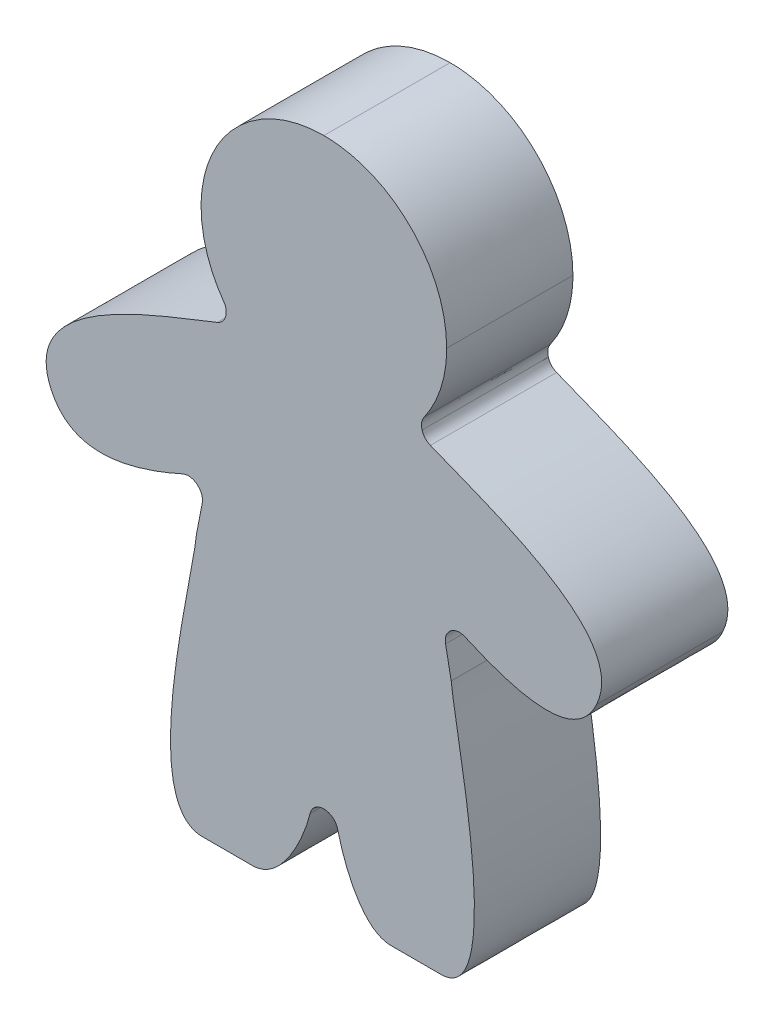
from build123d import *

# Parameters (mm, degrees)
BOSS_EXTRUDE1_DEPTH = 8


with BuildPart() as part:
    # Sketch1 → Boss-Extrude1 (new body)
    with BuildSketch(Plane.XY):
        with BuildLine():
            add(Edge.make_bspline(
                [(349.810713, 279.948316), (354.058983, 278.218336), (362.414043, 275.436976), (360.334413, 270.977116)],
                knots=[0, 0, 0, 0, 0.037037, 0.037037, 0.037037, 0.037037], degree=3))
            add(Edge.make_bspline(
                [(360.334413, 270.977116), (359.006193, 268.128438), (355.465774, 268.981367), (352.024264, 270.527477)],
                knots=[0.037037, 0.037037, 0.037037, 0.037037, 0.074074, 0.074074, 0.074074, 0.074074], degree=3))
            add(Edge.make_bspline(
                [(352.024264, 270.527477), (351.709894, 270.668687), (351.366814, 270.626027), (351.096634, 270.412097)],
                knots=[0.074074, 0.074074, 0.074074, 0.074074, 0.111111, 0.111111, 0.111111, 0.111111], degree=3))
            add(Edge.make_bspline(
                [(351.096634, 270.412097), (350.826454, 270.198077), (350.706394, 269.873897), (350.771824, 269.535587)],
                knots=[0.111111, 0.111111, 0.111111, 0.111111, 0.148148, 0.148148, 0.148148, 0.148148], degree=3))
            add(Edge.make_bspline(
                [(350.771824, 269.535587), (350.771824, 269.535587), (351.130204, 267.683837)],
                knots=[0.148148, 0.148148, 0.148148, 0.185185, 0.185185, 0.185185], degree=2))
            add(Edge.make_bspline(
                [(351.130204, 267.683837), (351.355835, 265.105245), (354.697894, 251.246599), (350.478784, 251.246599)],
                knots=[0.185185, 0.185185, 0.185185, 0.185185, 0.222222, 0.222222, 0.222222, 0.222222], degree=3))
            add(Edge.make_bspline(
                [(350.478784, 251.246599), (350.478783, 251.246599), (347.321944, 251.246599)],
                knots=[0.222222, 0.222222, 0.222222, 0.259259, 0.259259, 0.259259], degree=2))
            add(Edge.make_bspline(
                [(347.321944, 251.246599), (345.408544, 251.2466), (344.284715, 254.438899), (343.937045, 255.924799)],
                knots=[0.259259, 0.259259, 0.259259, 0.259259, 0.296296, 0.296296, 0.296296, 0.296296], degree=3))
            add(Edge.make_bspline(
                [(343.937045, 255.924799), (343.840835, 256.336099), (343.483895, 256.619599), (343.060895, 256.619599)],
                knots=[0.296296, 0.296296, 0.296296, 0.296296, 0.333333, 0.333333, 0.333333, 0.333333], degree=3))
            add(Edge.make_bspline(
                [(343.060895, 256.619599), (342.637805, 256.619509), (342.281045, 256.336009), (342.184835, 255.924799)],
                knots=[0.333333, 0.333333, 0.333333, 0.333333, 0.37037, 0.37037, 0.37037, 0.37037], degree=3))
            add(Edge.make_bspline(
                [(342.184835, 255.924799), (341.837165, 254.438899), (340.443245, 251.246599), (338.529845, 251.246599)],
                knots=[0.37037, 0.37037, 0.37037, 0.37037, 0.407407, 0.407407, 0.407407, 0.407407], degree=3))
            add(Edge.make_bspline(
                [(338.529845, 251.246599), (338.529844, 251.246599), (335.373095, 251.246599)],
                knots=[0.407407, 0.407407, 0.407407, 0.444444, 0.444444, 0.444444], degree=2))
            add(Edge.make_bspline(
                [(335.373095, 251.246599), (331.154258, 251.246603), (334.766138, 265.105249), (334.991768, 267.683839)],
                knots=[0.444444, 0.444444, 0.444444, 0.444444, 0.481481, 0.481481, 0.481481, 0.481481], degree=3))
            add(Edge.make_bspline(
                [(334.991768, 267.683839), (334.991768, 267.68384), (335.350148, 269.535679)],
                knots=[0.481481, 0.481481, 0.481481, 0.518519, 0.518519, 0.518519], degree=2))
            add(Edge.make_bspline(
                [(335.350148, 269.535679), (335.415577, 269.873989), (335.295517, 270.198169), (335.025337, 270.412189)],
                knots=[0.518519, 0.518519, 0.518519, 0.518519, 0.555556, 0.555556, 0.555556, 0.555556], degree=3))
            add(Edge.make_bspline(
                [(335.025337, 270.412189), (334.755158, 270.626119), (334.412078, 270.668779), (334.097708, 270.527569)],
                knots=[0.555556, 0.555556, 0.555556, 0.555556, 0.592593, 0.592593, 0.592593, 0.592593], degree=3))
            add(Edge.make_bspline(
                [(334.097708, 270.527569), (330.656199, 268.98137), (327.115779, 268.12853), (325.787469, 270.97721)],
                knots=[0.592593, 0.592593, 0.592593, 0.592593, 0.62963, 0.62963, 0.62963, 0.62963], degree=3))
            add(Edge.make_bspline(
                [(325.787469, 270.97721), (323.707843, 275.436978), (332.062811, 278.218248), (336.311171, 279.948228)],
                knots=[0.62963, 0.62963, 0.62963, 0.62963, 0.666667, 0.666667, 0.666667, 0.666667], degree=3))
            add(Edge.make_bspline(
                [(336.311171, 279.948228), (336.574241, 280.055418), (336.75595, 280.257017), (336.83551, 280.529717)],
                knots=[0.666667, 0.666667, 0.666667, 0.666667, 0.703704, 0.703704, 0.703704, 0.703704], degree=3))
            add(Edge.make_bspline(
                [(336.83551, 280.529717), (336.91507, 280.802417), (336.87016, 281.070167), (336.706, 281.301917)],
                knots=[0.703704, 0.703704, 0.703704, 0.703704, 0.740741, 0.740741, 0.740741, 0.740741], degree=3))
            add(Edge.make_bspline(
                [(336.706, 281.301917), (335.807261, 282.570917), (335.279051, 284.120897), (335.279051, 285.794267)],
                knots=[0.740741, 0.740741, 0.740741, 0.740741, 0.777778, 0.777778, 0.777778, 0.777778], degree=3))
            add(Edge.make_bspline(
                [(335.279051, 285.794267), (335.27905, 290.092035), (338.763128, 293.576116), (343.060898, 293.576117)],
                knots=[0.777778, 0.777778, 0.777778, 0.777778, 0.814815, 0.814815, 0.814815, 0.814815], degree=3))
            add(Edge.make_bspline(
                [(343.060898, 293.576117), (347.358666, 293.576115), (350.842744, 290.092035), (350.842743, 285.794265)],
                knots=[0.814815, 0.814815, 0.814815, 0.814815, 0.851852, 0.851852, 0.851852, 0.851852], degree=3))
            add(Edge.make_bspline(
                [(350.842743, 285.794265), (350.842743, 284.120985), (350.314533, 282.570916), (349.415883, 281.301916)],
                knots=[0.851852, 0.851852, 0.851852, 0.851852, 0.888889, 0.888889, 0.888889, 0.888889], degree=3))
            add(Edge.make_bspline(
                [(349.415883, 281.301916), (349.251723, 281.070166), (349.206813, 280.802416), (349.286373, 280.529716)],
                knots=[0.888889, 0.888889, 0.888889, 0.888889, 0.925926, 0.925926, 0.925926, 0.925926], degree=3))
            add(Edge.make_bspline(
                [(349.286373, 280.529716), (349.365933, 280.257106), (349.547733, 280.055506), (349.810713, 279.948316)],
                knots=[0.925926, 0.925926, 0.925926, 0.925926, 1, 1, 1, 1], degree=3))
        make_face()
    extrude(amount=BOSS_EXTRUDE1_DEPTH)


solid = part.part
